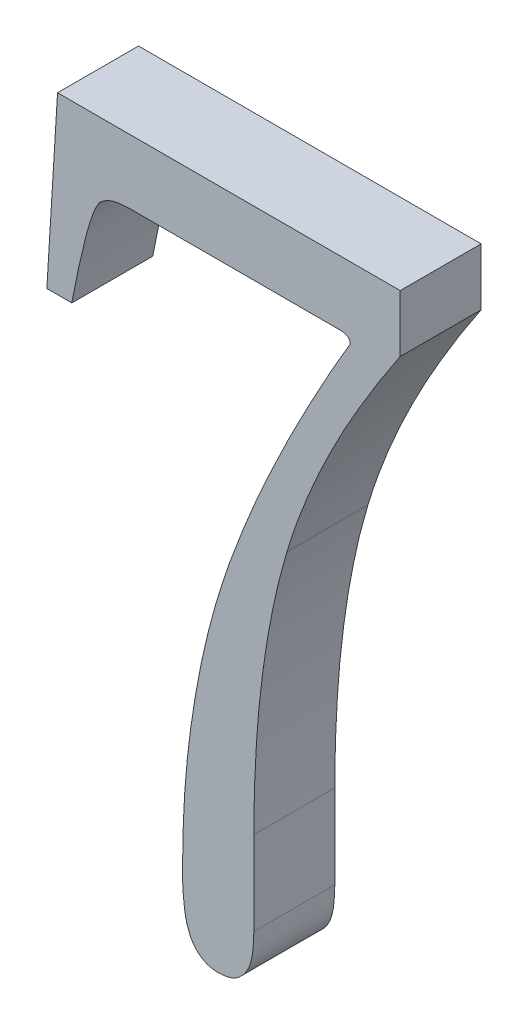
ISO-10303-21;
HEADER;
FILE_DESCRIPTION(('STEP AP214'),'2;1');
FILE_NAME('part.step','',(''),(''),'','','');
FILE_SCHEMA(('AUTOMOTIVE_DESIGN { 1 0 10303 214 1 1 1 1 }'));
ENDSEC;
DATA;
#1=APPLICATION_CONTEXT('core data for automotive mechanical design processes');
#2=APPLICATION_PROTOCOL_DEFINITION('international standard','automotive_design',2000,#1);
#3=PRODUCT_CONTEXT('',#1,'mechanical');
#4=PRODUCT('Part','Part','',(#3));
#5=PRODUCT_RELATED_PRODUCT_CATEGORY('part','',(#4));
#6=PRODUCT_DEFINITION_FORMATION('','',#4);
#7=PRODUCT_DEFINITION_CONTEXT('part definition',#1,'design');
#8=PRODUCT_DEFINITION('design','',#6,#7);
#9=PRODUCT_DEFINITION_SHAPE('','',#8);
#10=(LENGTH_UNIT() NAMED_UNIT(*) SI_UNIT(.MILLI.,.METRE.));
#11=(NAMED_UNIT(*) PLANE_ANGLE_UNIT() SI_UNIT($,.RADIAN.));
#12=(NAMED_UNIT(*) SI_UNIT($,.STERADIAN.) SOLID_ANGLE_UNIT());
#13=UNCERTAINTY_MEASURE_WITH_UNIT(LENGTH_MEASURE(1.E-05),#10,'distance_accuracy_value','');
#14=(GEOMETRIC_REPRESENTATION_CONTEXT(3) GLOBAL_UNCERTAINTY_ASSIGNED_CONTEXT((#13)) GLOBAL_UNIT_ASSIGNED_CONTEXT((#10,
#11,#12)) REPRESENTATION_CONTEXT('',''));
#15=CARTESIAN_POINT('',(0.,0.,0.));
#16=DIRECTION('',(0.,0.,1.));
#17=DIRECTION('',(1.,0.,0.));
#18=AXIS2_PLACEMENT_3D('',#15,#16,#17);
#19=CARTESIAN_POINT('',(2.24867724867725,17.1957671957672,3.));
#20=DIRECTION('',(-0.99813103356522,0.0611100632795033,0.));
#21=DIRECTION('',(-0.0611100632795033,-0.99813103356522,0.));
#22=AXIS2_PLACEMENT_3D('',#19,#20,#21);
#23=PLANE('',#22);
#24=DIRECTION('',(0.0611100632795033,0.99813103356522,0.));
#25=VECTOR('',#24,1.);
#26=CARTESIAN_POINT('',(2.24867724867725,17.1957671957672,0.));
#27=LINE('',#26,#25);
#28=CARTESIAN_POINT('',(2.24867724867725,17.1957671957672,0.));
#29=VERTEX_POINT('',#28);
#30=CARTESIAN_POINT('',(2.64550264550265,23.6772486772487,0.));
#31=VERTEX_POINT('',#30);
#32=EDGE_CURVE('E396',#29,#31,#27,.T.);
#33=ORIENTED_EDGE('',*,*,#32,.F.);
#34=DIRECTION('',(0.,0.,-1.));
#35=VECTOR('',#34,1.);
#36=CARTESIAN_POINT('',(2.24867724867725,17.1957671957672,3.));
#37=LINE('',#36,#35);
#38=CARTESIAN_POINT('',(2.24867724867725,17.1957671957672,3.));
#39=VERTEX_POINT('',#38);
#40=EDGE_CURVE('E11',#39,#29,#37,.T.);
#41=ORIENTED_EDGE('',*,*,#40,.F.);
#42=DIRECTION('',(0.0611100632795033,0.99813103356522,0.));
#43=VECTOR('',#42,1.);
#44=CARTESIAN_POINT('',(2.24867724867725,17.1957671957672,3.));
#45=LINE('',#44,#43);
#46=CARTESIAN_POINT('',(2.64550264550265,23.6772486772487,3.));
#47=VERTEX_POINT('',#46);
#48=EDGE_CURVE('E339',#39,#47,#45,.T.);
#49=ORIENTED_EDGE('',*,*,#48,.T.);
#50=DIRECTION('',(0.,0.,-1.));
#51=VECTOR('',#50,1.);
#52=CARTESIAN_POINT('',(2.64550264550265,23.6772486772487,3.));
#53=LINE('',#52,#51);
#54=EDGE_CURVE('E42',#47,#31,#53,.T.);
#55=ORIENTED_EDGE('',*,*,#54,.T.);
#56=EDGE_LOOP('',(#33,#41,#49,#55));
#57=FACE_BOUND('',#56,.T.);
#58=ADVANCED_FACE('F39',(#57),#23,.T.);
#59=CARTESIAN_POINT('',(3.17460317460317,17.1957671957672,3.));
#60=DIRECTION('',(0.,-1.,0.));
#61=DIRECTION('',(0.,0.,-1.));
#62=AXIS2_PLACEMENT_3D('',#59,#60,#61);
#63=PLANE('',#62);
#64=DIRECTION('',(-1.,0.,0.));
#65=VECTOR('',#64,1.);
#66=CARTESIAN_POINT('',(3.17460317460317,17.1957671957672,0.));
#67=LINE('',#66,#65);
#68=CARTESIAN_POINT('',(3.17460317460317,17.1957671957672,0.));
#69=VERTEX_POINT('',#68);
#70=EDGE_CURVE('E341',#69,#29,#67,.T.);
#71=ORIENTED_EDGE('',*,*,#70,.F.);
#72=DIRECTION('',(0.,0.,-1.));
#73=VECTOR('',#72,1.);
#74=CARTESIAN_POINT('',(3.17460317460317,17.1957671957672,3.));
#75=LINE('',#74,#73);
#76=CARTESIAN_POINT('',(3.17460317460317,17.1957671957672,3.));
#77=VERTEX_POINT('',#76);
#78=EDGE_CURVE('E49',#77,#69,#75,.T.);
#79=ORIENTED_EDGE('',*,*,#78,.F.);
#80=DIRECTION('',(-1.,0.,0.));
#81=VECTOR('',#80,1.);
#82=CARTESIAN_POINT('',(3.17460317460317,17.1957671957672,3.));
#83=LINE('',#82,#81);
#84=EDGE_CURVE('E182',#77,#39,#83,.T.);
#85=ORIENTED_EDGE('',*,*,#84,.T.);
#86=ORIENTED_EDGE('',*,*,#40,.T.);
#87=EDGE_LOOP('',(#71,#79,#85,#86));
#88=FACE_BOUND('',#87,.T.);
#89=ADVANCED_FACE('F538',(#88),#63,.T.);
#90=CARTESIAN_POINT('',(4.19851067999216,20.933764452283,3.));
#91=CARTESIAN_POINT('',(4.16119899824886,20.8740928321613,3.));
#92=CARTESIAN_POINT('',(4.0726667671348,20.7325054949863,3.));
#93=CARTESIAN_POINT('',(3.9603370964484,20.4664827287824,3.));
#94=CARTESIAN_POINT('',(3.84579289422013,20.1193902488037,3.));
#95=CARTESIAN_POINT('',(3.71634887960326,19.6942424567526,3.));
#96=CARTESIAN_POINT('',(3.59469285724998,19.1838157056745,3.));
#97=CARTESIAN_POINT('',(3.45485163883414,18.5952538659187,3.));
#98=CARTESIAN_POINT('',(3.31410550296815,17.9236254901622,3.));
#99=CARTESIAN_POINT('',(3.22283140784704,17.4473996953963,3.));
#100=CARTESIAN_POINT('',(3.17460317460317,17.1957671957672,3.));
#101=B_SPLINE_CURVE_WITH_KNOTS('',3,(#90,#91,#92,#93,#94,#95,#96,#97,#98,#99,#100),
.UNSPECIFIED.,.F.,.F.,(4,1,1,1,1,1,1,1,4),(0.,0.0541944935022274,0.128591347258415,
0.221755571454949,0.336073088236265,0.471036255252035,0.626171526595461,0.802473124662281,1.),.UNSPECIFIED.);
#102=DIRECTION('',(0.,0.,-1.));
#103=VECTOR('',#102,1.);
#104=SURFACE_OF_LINEAR_EXTRUSION('',#101,#103);
#105=CARTESIAN_POINT('',(4.19851067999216,20.933764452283,0.));
#106=CARTESIAN_POINT('',(4.16119899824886,20.8740928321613,0.));
#107=CARTESIAN_POINT('',(4.0726667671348,20.7325054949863,0.));
#108=CARTESIAN_POINT('',(3.9603370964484,20.4664827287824,0.));
#109=CARTESIAN_POINT('',(3.84579289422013,20.1193902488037,0.));
#110=CARTESIAN_POINT('',(3.71634887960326,19.6942424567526,0.));
#111=CARTESIAN_POINT('',(3.59469285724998,19.1838157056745,0.));
#112=CARTESIAN_POINT('',(3.45485163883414,18.5952538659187,0.));
#113=CARTESIAN_POINT('',(3.31410550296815,17.9236254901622,0.));
#114=CARTESIAN_POINT('',(3.22283140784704,17.4473996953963,0.));
#115=CARTESIAN_POINT('',(3.17460317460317,17.1957671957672,0.));
#116=B_SPLINE_CURVE_WITH_KNOTS('',3,(#105,#106,#107,#108,#109,#110,#111,#112,#113,#114,#115),
.UNSPECIFIED.,.F.,.F.,(4,1,1,1,1,1,1,1,4),(0.,0.0541944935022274,0.128591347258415,
0.221755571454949,0.336073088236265,0.471036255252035,0.626171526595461,0.802473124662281,1.),.UNSPECIFIED.);
#117=CARTESIAN_POINT('',(4.19851067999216,20.933764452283,0.));
#118=VERTEX_POINT('',#117);
#119=EDGE_CURVE('E168',#118,#69,#116,.T.);
#120=ORIENTED_EDGE('',*,*,#119,.F.);
#121=DIRECTION('',(0.,0.,-1.));
#122=VECTOR('',#121,1.);
#123=CARTESIAN_POINT('',(4.19851067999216,20.933764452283,3.));
#124=LINE('',#123,#122);
#125=CARTESIAN_POINT('',(4.19851067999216,20.933764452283,3.));
#126=VERTEX_POINT('',#125);
#127=EDGE_CURVE('E163',#126,#118,#124,.T.);
#128=ORIENTED_EDGE('',*,*,#127,.F.);
#129=EDGE_CURVE('E166',#126,#77,#101,.T.);
#130=ORIENTED_EDGE('',*,*,#129,.T.);
#131=ORIENTED_EDGE('',*,*,#78,.T.);
#132=EDGE_LOOP('',(#120,#128,#130,#131));
#133=FACE_BOUND('',#132,.T.);
#134=ADVANCED_FACE('F165',(#133),#104,.T.);
#135=CARTESIAN_POINT('',(5.29100529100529,21.2962962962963,3.));
#136=CARTESIAN_POINT('',(5.17811127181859,21.2909425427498,3.));
#137=CARTESIAN_POINT('',(4.96343796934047,21.2807621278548,3.));
#138=CARTESIAN_POINT('',(4.66011938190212,21.2226561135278,3.));
#139=CARTESIAN_POINT('',(4.40260331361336,21.1031911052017,3.));
#140=CARTESIAN_POINT('',(4.26504484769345,20.9889975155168,3.));
#141=CARTESIAN_POINT('',(4.19851067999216,20.933764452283,3.));
#142=B_SPLINE_CURVE_WITH_KNOTS('',3,(#135,#136,#137,#138,#139,#140,#141),.UNSPECIFIED.,.F.,.F.,
(4,1,1,1,4),(0.,0.287395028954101,0.546495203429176,0.780649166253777,1.),.UNSPECIFIED.);
#143=DIRECTION('',(0.,0.,-1.));
#144=VECTOR('',#143,1.);
#145=SURFACE_OF_LINEAR_EXTRUSION('',#142,#144);
#146=CARTESIAN_POINT('',(5.29100529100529,21.2962962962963,0.));
#147=CARTESIAN_POINT('',(5.17811127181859,21.2909425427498,0.));
#148=CARTESIAN_POINT('',(4.96343796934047,21.2807621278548,0.));
#149=CARTESIAN_POINT('',(4.66011938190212,21.2226561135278,0.));
#150=CARTESIAN_POINT('',(4.40260331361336,21.1031911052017,0.));
#151=CARTESIAN_POINT('',(4.26504484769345,20.9889975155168,0.));
#152=CARTESIAN_POINT('',(4.19851067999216,20.933764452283,0.));
#153=B_SPLINE_CURVE_WITH_KNOTS('',3,(#146,#147,#148,#149,#150,#151,#152),.UNSPECIFIED.,.F.,.F.,
(4,1,1,1,4),(0.,0.287395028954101,0.546495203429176,0.780649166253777,1.),.UNSPECIFIED.);
#154=CARTESIAN_POINT('',(5.29100529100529,21.2962962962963,0.));
#155=VERTEX_POINT('',#154);
#156=EDGE_CURVE('E348',#155,#118,#153,.T.);
#157=ORIENTED_EDGE('',*,*,#156,.F.);
#158=DIRECTION('',(0.,0.,-1.));
#159=VECTOR('',#158,1.);
#160=CARTESIAN_POINT('',(5.29100529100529,21.2962962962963,3.));
#161=LINE('',#160,#159);
#162=CARTESIAN_POINT('',(5.29100529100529,21.2962962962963,3.));
#163=VERTEX_POINT('',#162);
#164=EDGE_CURVE('E174',#163,#155,#161,.T.);
#165=ORIENTED_EDGE('',*,*,#164,.F.);
#166=EDGE_CURVE('E180',#163,#126,#142,.T.);
#167=ORIENTED_EDGE('',*,*,#166,.T.);
#168=ORIENTED_EDGE('',*,*,#127,.T.);
#169=EDGE_LOOP('',(#157,#165,#167,#168));
#170=FACE_BOUND('',#169,.T.);
#171=ADVANCED_FACE('F185',(#170),#145,.T.);
#172=CARTESIAN_POINT('',(13.0952380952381,21.2962962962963,3.));
#173=DIRECTION('',(0.,-1.,0.));
#174=DIRECTION('',(0.,0.,-1.));
#175=AXIS2_PLACEMENT_3D('',#172,#173,#174);
#176=PLANE('',#175);
#177=DIRECTION('',(-1.,0.,0.));
#178=VECTOR('',#177,1.);
#179=CARTESIAN_POINT('',(13.0952380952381,21.2962962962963,0.));
#180=LINE('',#179,#178);
#181=CARTESIAN_POINT('',(13.0952380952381,21.2962962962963,0.));
#182=VERTEX_POINT('',#181);
#183=EDGE_CURVE('E489',#182,#155,#180,.T.);
#184=ORIENTED_EDGE('',*,*,#183,.F.);
#185=DIRECTION('',(0.,0.,-1.));
#186=VECTOR('',#185,1.);
#187=CARTESIAN_POINT('',(13.0952380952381,21.2962962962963,3.));
#188=LINE('',#187,#186);
#189=CARTESIAN_POINT('',(13.0952380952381,21.2962962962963,3.));
#190=VERTEX_POINT('',#189);
#191=EDGE_CURVE('E358',#190,#182,#188,.T.);
#192=ORIENTED_EDGE('',*,*,#191,.F.);
#193=DIRECTION('',(-1.,0.,0.));
#194=VECTOR('',#193,1.);
#195=CARTESIAN_POINT('',(13.0952380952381,21.2962962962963,3.));
#196=LINE('',#195,#194);
#197=EDGE_CURVE('E187',#190,#163,#196,.T.);
#198=ORIENTED_EDGE('',*,*,#197,.T.);
#199=ORIENTED_EDGE('',*,*,#164,.T.);
#200=EDGE_LOOP('',(#184,#192,#198,#199));
#201=FACE_BOUND('',#200,.T.);
#202=ADVANCED_FACE('F207',(#201),#176,.T.);
#203=CARTESIAN_POINT('',(13.4920634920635,21.031746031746,3.));
#204=CARTESIAN_POINT('',(13.4882682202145,21.0725959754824,3.));
#205=CARTESIAN_POINT('',(13.4809631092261,21.1512236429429,3.));
#206=CARTESIAN_POINT('',(13.3921041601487,21.2469746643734,3.));
#207=CARTESIAN_POINT('',(13.2556322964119,21.2910057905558,3.));
#208=CARTESIAN_POINT('',(13.1526653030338,21.2944020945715,3.));
#209=CARTESIAN_POINT('',(13.0952380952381,21.2962962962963,3.));
#210=B_SPLINE_CURVE_WITH_KNOTS('',3,(#203,#204,#205,#206,#207,#208,#209),.UNSPECIFIED.,.F.,.F.,
(4,1,1,1,4),(0.,0.22251847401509,0.428301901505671,0.681150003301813,1.),.UNSPECIFIED.);
#211=DIRECTION('',(0.,0.,-1.));
#212=VECTOR('',#211,1.);
#213=SURFACE_OF_LINEAR_EXTRUSION('',#210,#212);
#214=CARTESIAN_POINT('',(13.4920634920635,21.031746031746,0.));
#215=CARTESIAN_POINT('',(13.4882682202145,21.0725959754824,0.));
#216=CARTESIAN_POINT('',(13.4809631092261,21.1512236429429,0.));
#217=CARTESIAN_POINT('',(13.3921041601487,21.2469746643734,0.));
#218=CARTESIAN_POINT('',(13.2556322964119,21.2910057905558,0.));
#219=CARTESIAN_POINT('',(13.1526653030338,21.2944020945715,0.));
#220=CARTESIAN_POINT('',(13.0952380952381,21.2962962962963,0.));
#221=B_SPLINE_CURVE_WITH_KNOTS('',3,(#214,#215,#216,#217,#218,#219,#220),.UNSPECIFIED.,.F.,.F.,
(4,1,1,1,4),(0.,0.22251847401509,0.428301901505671,0.681150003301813,1.),.UNSPECIFIED.);
#222=CARTESIAN_POINT('',(13.4920634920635,21.031746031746,0.));
#223=VERTEX_POINT('',#222);
#224=EDGE_CURVE('E480',#223,#182,#221,.T.);
#225=ORIENTED_EDGE('',*,*,#224,.F.);
#226=DIRECTION('',(0.,0.,-1.));
#227=VECTOR('',#226,1.);
#228=CARTESIAN_POINT('',(13.4920634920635,21.031746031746,3.));
#229=LINE('',#228,#227);
#230=CARTESIAN_POINT('',(13.4920634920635,21.031746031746,3.));
#231=VERTEX_POINT('',#230);
#232=EDGE_CURVE('E361',#231,#223,#229,.T.);
#233=ORIENTED_EDGE('',*,*,#232,.F.);
#234=EDGE_CURVE('E190',#231,#190,#210,.T.);
#235=ORIENTED_EDGE('',*,*,#234,.T.);
#236=ORIENTED_EDGE('',*,*,#191,.T.);
#237=EDGE_LOOP('',(#225,#233,#235,#236));
#238=FACE_BOUND('',#237,.T.);
#239=ADVANCED_FACE('F211',(#238),#213,.T.);
#240=CARTESIAN_POINT('',(9.02900254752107,11.8067803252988,3.));
#241=CARTESIAN_POINT('',(9.16608637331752,12.1732388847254,3.));
#242=CARTESIAN_POINT('',(9.44406047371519,12.9163315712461,3.));
#243=CARTESIAN_POINT('',(9.89826375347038,14.031894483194,3.));
#244=CARTESIAN_POINT('',(10.4019146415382,15.1599348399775,3.));
#245=CARTESIAN_POINT('',(10.9395374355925,16.3055951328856,3.));
#246=CARTESIAN_POINT('',(11.5180050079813,17.4668857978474,3.));
#247=CARTESIAN_POINT('',(12.137830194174,18.6432083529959,3.));
#248=CARTESIAN_POINT('',(12.7898906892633,19.8390796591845,3.));
#249=CARTESIAN_POINT('',(13.2563019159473,20.6312963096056,3.));
#250=CARTESIAN_POINT('',(13.4920634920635,21.031746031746,3.));
#251=B_SPLINE_CURVE_WITH_KNOTS('',3,(#240,#241,#242,#243,#244,#245,#246,#247,#248,#249,#250),
.UNSPECIFIED.,.F.,.F.,(4,1,1,1,1,1,1,1,4),(0.,0.114375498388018,0.231926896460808,
0.352039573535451,0.475476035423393,0.601865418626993,0.731268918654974,0.864161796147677,1.),.UNSPECIFIED.);
#252=DIRECTION('',(0.,0.,-1.));
#253=VECTOR('',#252,1.);
#254=SURFACE_OF_LINEAR_EXTRUSION('',#251,#253);
#255=CARTESIAN_POINT('',(9.02900254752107,11.8067803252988,0.));
#256=CARTESIAN_POINT('',(9.16608637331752,12.1732388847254,0.));
#257=CARTESIAN_POINT('',(9.44406047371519,12.9163315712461,0.));
#258=CARTESIAN_POINT('',(9.89826375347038,14.031894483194,0.));
#259=CARTESIAN_POINT('',(10.4019146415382,15.1599348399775,0.));
#260=CARTESIAN_POINT('',(10.9395374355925,16.3055951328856,0.));
#261=CARTESIAN_POINT('',(11.5180050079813,17.4668857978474,0.));
#262=CARTESIAN_POINT('',(12.137830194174,18.6432083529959,0.));
#263=CARTESIAN_POINT('',(12.7898906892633,19.8390796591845,0.));
#264=CARTESIAN_POINT('',(13.2563019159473,20.6312963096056,0.));
#265=CARTESIAN_POINT('',(13.4920634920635,21.031746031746,0.));
#266=B_SPLINE_CURVE_WITH_KNOTS('',3,(#255,#256,#257,#258,#259,#260,#261,#262,#263,#264,#265),
.UNSPECIFIED.,.F.,.F.,(4,1,1,1,1,1,1,1,4),(0.,0.114375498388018,0.231926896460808,
0.352039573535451,0.475476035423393,0.601865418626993,0.731268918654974,0.864161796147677,1.),.UNSPECIFIED.);
#267=CARTESIAN_POINT('',(9.02900254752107,11.8067803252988,0.));
#268=VERTEX_POINT('',#267);
#269=EDGE_CURVE('E471',#268,#223,#266,.T.);
#270=ORIENTED_EDGE('',*,*,#269,.F.);
#271=DIRECTION('',(0.,0.,-1.));
#272=VECTOR('',#271,1.);
#273=CARTESIAN_POINT('',(9.02900254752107,11.8067803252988,3.));
#274=LINE('',#273,#272);
#275=CARTESIAN_POINT('',(9.02900254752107,11.8067803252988,3.));
#276=VERTEX_POINT('',#275);
#277=EDGE_CURVE('E364',#276,#268,#274,.T.);
#278=ORIENTED_EDGE('',*,*,#277,.F.);
#279=EDGE_CURVE('E224',#276,#231,#251,.T.);
#280=ORIENTED_EDGE('',*,*,#279,.T.);
#281=ORIENTED_EDGE('',*,*,#232,.T.);
#282=EDGE_LOOP('',(#270,#278,#280,#281));
#283=FACE_BOUND('',#282,.T.);
#284=ADVANCED_FACE('F215',(#283),#254,.T.);
#285=CARTESIAN_POINT('',(7.27513227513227,1.05820105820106,3.));
#286=CARTESIAN_POINT('',(7.28160009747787,1.53840215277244,3.));
#287=CARTESIAN_POINT('',(7.29443415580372,2.49126209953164,3.));
#288=CARTESIAN_POINT('',(7.37194548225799,3.90528842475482,3.));
#289=CARTESIAN_POINT('',(7.50912942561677,5.29310268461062,3.));
#290=CARTESIAN_POINT('',(7.70634409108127,6.6506944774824,3.));
#291=CARTESIAN_POINT('',(7.95060801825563,7.98317568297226,3.));
#292=CARTESIAN_POINT('',(8.24849569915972,9.28667035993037,3.));
#293=CARTESIAN_POINT('',(8.60439717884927,10.5622466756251,3.));
#294=CARTESIAN_POINT('',(8.88791117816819,11.3932364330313,3.));
#295=CARTESIAN_POINT('',(9.02900254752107,11.8067803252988,3.));
#296=B_SPLINE_CURVE_WITH_KNOTS('',3,(#285,#286,#287,#288,#289,#290,#291,#292,#293,#294,#295),
.UNSPECIFIED.,.F.,.F.,(4,1,1,1,1,1,1,1,4),(0.,0.131640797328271,0.261213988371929,
0.388076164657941,0.513808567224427,0.637173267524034,0.759343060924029,0.880236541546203,1.),.UNSPECIFIED.);
#297=DIRECTION('',(0.,0.,-1.));
#298=VECTOR('',#297,1.);
#299=SURFACE_OF_LINEAR_EXTRUSION('',#296,#298);
#300=CARTESIAN_POINT('',(7.27513227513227,1.05820105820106,0.));
#301=CARTESIAN_POINT('',(7.28160009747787,1.53840215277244,0.));
#302=CARTESIAN_POINT('',(7.29443415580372,2.49126209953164,0.));
#303=CARTESIAN_POINT('',(7.37194548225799,3.90528842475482,0.));
#304=CARTESIAN_POINT('',(7.50912942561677,5.29310268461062,0.));
#305=CARTESIAN_POINT('',(7.70634409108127,6.6506944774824,0.));
#306=CARTESIAN_POINT('',(7.95060801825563,7.98317568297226,0.));
#307=CARTESIAN_POINT('',(8.24849569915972,9.28667035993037,0.));
#308=CARTESIAN_POINT('',(8.60439717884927,10.5622466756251,0.));
#309=CARTESIAN_POINT('',(8.88791117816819,11.3932364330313,0.));
#310=CARTESIAN_POINT('',(9.02900254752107,11.8067803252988,0.));
#311=B_SPLINE_CURVE_WITH_KNOTS('',3,(#300,#301,#302,#303,#304,#305,#306,#307,#308,#309,#310),
.UNSPECIFIED.,.F.,.F.,(4,1,1,1,1,1,1,1,4),(0.,0.131640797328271,0.261213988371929,
0.388076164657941,0.513808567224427,0.637173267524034,0.759343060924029,0.880236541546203,1.),.UNSPECIFIED.);
#312=CARTESIAN_POINT('',(7.27513227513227,1.05820105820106,0.));
#313=VERTEX_POINT('',#312);
#314=EDGE_CURVE('E462',#313,#268,#311,.T.);
#315=ORIENTED_EDGE('',*,*,#314,.F.);
#316=DIRECTION('',(0.,0.,-1.));
#317=VECTOR('',#316,1.);
#318=CARTESIAN_POINT('',(7.27513227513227,1.05820105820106,3.));
#319=LINE('',#318,#317);
#320=CARTESIAN_POINT('',(7.27513227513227,1.05820105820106,3.));
#321=VERTEX_POINT('',#320);
#322=EDGE_CURVE('E367',#321,#313,#319,.T.);
#323=ORIENTED_EDGE('',*,*,#322,.F.);
#324=EDGE_CURVE('E234',#321,#276,#296,.T.);
#325=ORIENTED_EDGE('',*,*,#324,.T.);
#326=ORIENTED_EDGE('',*,*,#277,.T.);
#327=EDGE_LOOP('',(#315,#323,#325,#326));
#328=FACE_BOUND('',#327,.T.);
#329=ADVANCED_FACE('F252',(#328),#299,.T.);
#330=CARTESIAN_POINT('',(7.57397609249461,-0.960219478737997,3.));
#331=CARTESIAN_POINT('',(7.52603342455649,-0.840535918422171,3.));
#332=CARTESIAN_POINT('',(7.41972281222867,-0.575143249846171,3.));
#333=CARTESIAN_POINT('',(7.33832415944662,-0.110616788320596,3.));
#334=CARTESIAN_POINT('',(7.28487612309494,0.442814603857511,3.));
#335=CARTESIAN_POINT('',(7.27854856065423,0.842440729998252,3.));
#336=CARTESIAN_POINT('',(7.27513227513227,1.05820105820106,3.));
#337=B_SPLINE_CURVE_WITH_KNOTS('',3,(#330,#331,#332,#333,#334,#335,#336),.UNSPECIFIED.,.F.,.F.,
(4,1,1,1,4),(0.,0.187877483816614,0.416609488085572,0.685024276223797,1.),.UNSPECIFIED.);
#338=DIRECTION('',(0.,0.,-1.));
#339=VECTOR('',#338,1.);
#340=SURFACE_OF_LINEAR_EXTRUSION('',#337,#339);
#341=CARTESIAN_POINT('',(7.57397609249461,-0.960219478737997,0.));
#342=CARTESIAN_POINT('',(7.52603342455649,-0.840535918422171,0.));
#343=CARTESIAN_POINT('',(7.41972281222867,-0.575143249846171,0.));
#344=CARTESIAN_POINT('',(7.33832415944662,-0.110616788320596,0.));
#345=CARTESIAN_POINT('',(7.28487612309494,0.442814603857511,0.));
#346=CARTESIAN_POINT('',(7.27854856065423,0.842440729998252,0.));
#347=CARTESIAN_POINT('',(7.27513227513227,1.05820105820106,0.));
#348=B_SPLINE_CURVE_WITH_KNOTS('',3,(#341,#342,#343,#344,#345,#346,#347),.UNSPECIFIED.,.F.,.F.,
(4,1,1,1,4),(0.,0.187877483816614,0.416609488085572,0.685024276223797,1.),.UNSPECIFIED.);
#349=CARTESIAN_POINT('',(7.57397609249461,-0.960219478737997,0.));
#350=VERTEX_POINT('',#349);
#351=EDGE_CURVE('E453',#350,#313,#348,.T.);
#352=ORIENTED_EDGE('',*,*,#351,.F.);
#353=DIRECTION('',(0.,0.,-1.));
#354=VECTOR('',#353,1.);
#355=CARTESIAN_POINT('',(7.57397609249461,-0.960219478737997,3.));
#356=LINE('',#355,#354);
#357=CARTESIAN_POINT('',(7.57397609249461,-0.960219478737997,3.));
#358=VERTEX_POINT('',#357);
#359=EDGE_CURVE('E370',#358,#350,#356,.T.);
#360=ORIENTED_EDGE('',*,*,#359,.F.);
#361=EDGE_CURVE('E244',#358,#321,#337,.T.);
#362=ORIENTED_EDGE('',*,*,#361,.T.);
#363=ORIENTED_EDGE('',*,*,#322,.T.);
#364=EDGE_LOOP('',(#352,#360,#362,#363));
#365=FACE_BOUND('',#364,.T.);
#366=ADVANCED_FACE('F255',(#365),#340,.T.);
#367=CARTESIAN_POINT('',(8.5978835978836,-1.58730158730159,3.));
#368=CARTESIAN_POINT('',(8.49208149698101,-1.58047349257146,3.));
#369=CARTESIAN_POINT('',(8.28633657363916,-1.56719544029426,3.));
#370=CARTESIAN_POINT('',(7.99999480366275,-1.44131274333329,3.));
#371=CARTESIAN_POINT('',(7.75507631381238,-1.23634905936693,3.));
#372=CARTESIAN_POINT('',(7.63641890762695,-1.05542813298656,3.));
#373=CARTESIAN_POINT('',(7.57397609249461,-0.960219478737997,3.));
#374=B_SPLINE_CURVE_WITH_KNOTS('',3,(#367,#368,#369,#370,#371,#372,#373),.UNSPECIFIED.,.F.,.F.,
(4,1,1,1,4),(0.,0.250662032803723,0.487442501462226,0.730269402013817,1.),.UNSPECIFIED.);
#375=DIRECTION('',(0.,0.,-1.));
#376=VECTOR('',#375,1.);
#377=SURFACE_OF_LINEAR_EXTRUSION('',#374,#376);
#378=CARTESIAN_POINT('',(8.5978835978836,-1.58730158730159,0.));
#379=CARTESIAN_POINT('',(8.49208149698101,-1.58047349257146,0.));
#380=CARTESIAN_POINT('',(8.28633657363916,-1.56719544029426,0.));
#381=CARTESIAN_POINT('',(7.99999480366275,-1.44131274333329,0.));
#382=CARTESIAN_POINT('',(7.75507631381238,-1.23634905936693,0.));
#383=CARTESIAN_POINT('',(7.63641890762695,-1.05542813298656,0.));
#384=CARTESIAN_POINT('',(7.57397609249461,-0.960219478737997,0.));
#385=B_SPLINE_CURVE_WITH_KNOTS('',3,(#378,#379,#380,#381,#382,#383,#384),.UNSPECIFIED.,.F.,.F.,
(4,1,1,1,4),(0.,0.250662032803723,0.487442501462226,0.730269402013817,1.),.UNSPECIFIED.);
#386=CARTESIAN_POINT('',(8.5978835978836,-1.58730158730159,0.));
#387=VERTEX_POINT('',#386);
#388=EDGE_CURVE('E444',#387,#350,#385,.T.);
#389=ORIENTED_EDGE('',*,*,#388,.F.);
#390=DIRECTION('',(0.,0.,-1.));
#391=VECTOR('',#390,1.);
#392=CARTESIAN_POINT('',(8.5978835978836,-1.58730158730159,3.));
#393=LINE('',#392,#391);
#394=CARTESIAN_POINT('',(8.5978835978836,-1.58730158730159,3.));
#395=VERTEX_POINT('',#394);
#396=EDGE_CURVE('E373',#395,#387,#393,.T.);
#397=ORIENTED_EDGE('',*,*,#396,.F.);
#398=EDGE_CURVE('E267',#395,#358,#374,.T.);
#399=ORIENTED_EDGE('',*,*,#398,.T.);
#400=ORIENTED_EDGE('',*,*,#359,.T.);
#401=EDGE_LOOP('',(#389,#397,#399,#400));
#402=FACE_BOUND('',#401,.T.);
#403=ADVANCED_FACE('F259',(#402),#377,.T.);
#404=CARTESIAN_POINT('',(9.5581030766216,-1.15618263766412,3.));
#405=CARTESIAN_POINT('',(9.49879024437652,-1.22126769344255,3.));
#406=CARTESIAN_POINT('',(9.3809814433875,-1.35054144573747,3.));
#407=CARTESIAN_POINT('',(9.15278187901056,-1.49240324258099,3.));
#408=CARTESIAN_POINT('',(8.88523636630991,-1.56964495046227,3.));
#409=CARTESIAN_POINT('',(8.69635520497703,-1.58125091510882,3.));
#410=CARTESIAN_POINT('',(8.5978835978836,-1.58730158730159,3.));
#411=B_SPLINE_CURVE_WITH_KNOTS('',3,(#404,#405,#406,#407,#408,#409,#410),.UNSPECIFIED.,.F.,.F.,
(4,1,1,1,4),(0.,0.241635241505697,0.479942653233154,0.728872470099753,1.),.UNSPECIFIED.);
#412=DIRECTION('',(0.,0.,-1.));
#413=VECTOR('',#412,1.);
#414=SURFACE_OF_LINEAR_EXTRUSION('',#411,#413);
#415=CARTESIAN_POINT('',(9.5581030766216,-1.15618263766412,0.));
#416=CARTESIAN_POINT('',(9.49879024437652,-1.22126769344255,0.));
#417=CARTESIAN_POINT('',(9.3809814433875,-1.35054144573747,0.));
#418=CARTESIAN_POINT('',(9.15278187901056,-1.49240324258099,0.));
#419=CARTESIAN_POINT('',(8.88523636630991,-1.56964495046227,0.));
#420=CARTESIAN_POINT('',(8.69635520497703,-1.58125091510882,0.));
#421=CARTESIAN_POINT('',(8.5978835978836,-1.58730158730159,0.));
#422=B_SPLINE_CURVE_WITH_KNOTS('',3,(#415,#416,#417,#418,#419,#420,#421),.UNSPECIFIED.,.F.,.F.,
(4,1,1,1,4),(0.,0.241635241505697,0.479942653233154,0.728872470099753,1.),.UNSPECIFIED.);
#423=CARTESIAN_POINT('',(9.5581030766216,-1.15618263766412,0.));
#424=VERTEX_POINT('',#423);
#425=EDGE_CURVE('E435',#424,#387,#422,.T.);
#426=ORIENTED_EDGE('',*,*,#425,.F.);
#427=DIRECTION('',(0.,0.,-1.));
#428=VECTOR('',#427,1.);
#429=CARTESIAN_POINT('',(9.5581030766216,-1.15618263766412,3.));
#430=LINE('',#429,#428);
#431=CARTESIAN_POINT('',(9.5581030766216,-1.15618263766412,3.));
#432=VERTEX_POINT('',#431);
#433=EDGE_CURVE('E376',#432,#424,#430,.T.);
#434=ORIENTED_EDGE('',*,*,#433,.F.);
#435=EDGE_CURVE('E273',#432,#395,#411,.T.);
#436=ORIENTED_EDGE('',*,*,#435,.T.);
#437=ORIENTED_EDGE('',*,*,#396,.T.);
#438=EDGE_LOOP('',(#426,#434,#436,#437));
#439=FACE_BOUND('',#438,.T.);
#440=ADVANCED_FACE('F263',(#439),#414,.T.);
#441=CARTESIAN_POINT('',(9.92063492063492,0.396825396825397,3.));
#442=CARTESIAN_POINT('',(9.91562175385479,0.223515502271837,3.));
#443=CARTESIAN_POINT('',(9.90640621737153,-0.0950742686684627,3.));
#444=CARTESIAN_POINT('',(9.84961978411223,-0.531595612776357,3.));
#445=CARTESIAN_POINT('',(9.73727645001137,-0.885927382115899,3.));
#446=CARTESIAN_POINT('',(9.61417782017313,-1.07160258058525,3.));
#447=CARTESIAN_POINT('',(9.5581030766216,-1.15618263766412,3.));
#448=B_SPLINE_CURVE_WITH_KNOTS('',3,(#441,#442,#443,#444,#445,#446,#447),.UNSPECIFIED.,.F.,.F.,
(4,1,1,1,4),(0.,0.320613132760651,0.589372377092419,0.812948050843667,1.),.UNSPECIFIED.);
#449=DIRECTION('',(0.,0.,-1.));
#450=VECTOR('',#449,1.);
#451=SURFACE_OF_LINEAR_EXTRUSION('',#448,#450);
#452=CARTESIAN_POINT('',(9.92063492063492,0.396825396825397,0.));
#453=CARTESIAN_POINT('',(9.91562175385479,0.223515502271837,0.));
#454=CARTESIAN_POINT('',(9.90640621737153,-0.0950742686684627,0.));
#455=CARTESIAN_POINT('',(9.84961978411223,-0.531595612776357,0.));
#456=CARTESIAN_POINT('',(9.73727645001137,-0.885927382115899,0.));
#457=CARTESIAN_POINT('',(9.61417782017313,-1.07160258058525,0.));
#458=CARTESIAN_POINT('',(9.5581030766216,-1.15618263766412,0.));
#459=B_SPLINE_CURVE_WITH_KNOTS('',3,(#452,#453,#454,#455,#456,#457,#458),.UNSPECIFIED.,.F.,.F.,
(4,1,1,1,4),(0.,0.320613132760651,0.589372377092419,0.812948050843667,1.),.UNSPECIFIED.);
#460=CARTESIAN_POINT('',(9.92063492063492,0.396825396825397,0.));
#461=VERTEX_POINT('',#460);
#462=EDGE_CURVE('E429',#461,#424,#459,.T.);
#463=ORIENTED_EDGE('',*,*,#462,.F.);
#464=DIRECTION('',(0.,0.,-1.));
#465=VECTOR('',#464,1.);
#466=CARTESIAN_POINT('',(9.92063492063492,0.396825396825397,3.));
#467=LINE('',#466,#465);
#468=CARTESIAN_POINT('',(9.92063492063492,0.396825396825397,3.));
#469=VERTEX_POINT('',#468);
#470=EDGE_CURVE('E379',#469,#461,#467,.T.);
#471=ORIENTED_EDGE('',*,*,#470,.F.);
#472=EDGE_CURVE('E283',#469,#432,#448,.T.);
#473=ORIENTED_EDGE('',*,*,#472,.T.);
#474=ORIENTED_EDGE('',*,*,#433,.T.);
#475=EDGE_LOOP('',(#463,#471,#473,#474));
#476=FACE_BOUND('',#475,.T.);
#477=ADVANCED_FACE('F298',(#476),#451,.T.);
#478=CARTESIAN_POINT('',(9.92063492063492,3.50774054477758,3.));
#479=DIRECTION('',(1.,0.,0.));
#480=DIRECTION('',(0.,0.,-1.));
#481=AXIS2_PLACEMENT_3D('',#478,#479,#480);
#482=PLANE('',#481);
#483=DIRECTION('',(0.,-1.,0.));
#484=VECTOR('',#483,1.);
#485=CARTESIAN_POINT('',(9.92063492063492,3.50774054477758,0.));
#486=LINE('',#485,#484);
#487=CARTESIAN_POINT('',(9.92063492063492,3.50774054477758,0.));
#488=VERTEX_POINT('',#487);
#489=EDGE_CURVE('E422',#488,#461,#486,.T.);
#490=ORIENTED_EDGE('',*,*,#489,.F.);
#491=DIRECTION('',(0.,0.,-1.));
#492=VECTOR('',#491,1.);
#493=CARTESIAN_POINT('',(9.92063492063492,3.50774054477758,3.));
#494=LINE('',#493,#492);
#495=CARTESIAN_POINT('',(9.92063492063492,3.50774054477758,3.));
#496=VERTEX_POINT('',#495);
#497=EDGE_CURVE('E382',#496,#488,#494,.T.);
#498=ORIENTED_EDGE('',*,*,#497,.F.);
#499=DIRECTION('',(0.,-1.,0.));
#500=VECTOR('',#499,1.);
#501=CARTESIAN_POINT('',(9.92063492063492,3.50774054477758,3.));
#502=LINE('',#501,#500);
#503=EDGE_CURVE('E293',#496,#469,#502,.T.);
#504=ORIENTED_EDGE('',*,*,#503,.T.);
#505=ORIENTED_EDGE('',*,*,#470,.T.);
#506=EDGE_LOOP('',(#490,#498,#504,#505));
#507=FACE_BOUND('',#506,.T.);
#508=ADVANCED_FACE('F301',(#507),#482,.T.);
#509=CARTESIAN_POINT('',(11.1454046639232,13.1932196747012,3.));
#510=CARTESIAN_POINT('',(11.0452807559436,12.8447203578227,3.));
#511=CARTESIAN_POINT('',(10.8420775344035,12.1374349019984,3.));
#512=CARTESIAN_POINT('',(10.6031931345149,11.0399211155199,3.));
#513=CARTESIAN_POINT('',(10.3896772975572,9.89847717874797,3.));
#514=CARTESIAN_POINT('',(10.2223663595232,8.70799355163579,3.));
#515=CARTESIAN_POINT('',(10.0814392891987,7.47341673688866,3.));
#516=CARTESIAN_POINT('',(9.99345255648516,6.19178292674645,3.));
#517=CARTESIAN_POINT('',(9.93095296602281,4.86540586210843,3.));
#518=CARTESIAN_POINT('',(9.92411052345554,3.96506605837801,3.));
#519=CARTESIAN_POINT('',(9.92063492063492,3.50774054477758,3.));
#520=B_SPLINE_CURVE_WITH_KNOTS('',3,(#509,#510,#511,#512,#513,#514,#515,#516,#517,#518,#519),
.UNSPECIFIED.,.F.,.F.,(4,1,1,1,1,1,1,1,4),(0.,0.111019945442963,0.225316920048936,
0.343813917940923,0.466598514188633,0.593405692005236,0.724283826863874,0.859950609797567,1.),.UNSPECIFIED.);
#521=DIRECTION('',(0.,0.,-1.));
#522=VECTOR('',#521,1.);
#523=SURFACE_OF_LINEAR_EXTRUSION('',#520,#522);
#524=CARTESIAN_POINT('',(11.1454046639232,13.1932196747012,0.));
#525=CARTESIAN_POINT('',(11.0452807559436,12.8447203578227,0.));
#526=CARTESIAN_POINT('',(10.8420775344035,12.1374349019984,0.));
#527=CARTESIAN_POINT('',(10.6031931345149,11.0399211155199,0.));
#528=CARTESIAN_POINT('',(10.3896772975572,9.89847717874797,0.));
#529=CARTESIAN_POINT('',(10.2223663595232,8.70799355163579,0.));
#530=CARTESIAN_POINT('',(10.0814392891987,7.47341673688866,0.));
#531=CARTESIAN_POINT('',(9.99345255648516,6.19178292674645,0.));
#532=CARTESIAN_POINT('',(9.93095296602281,4.86540586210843,0.));
#533=CARTESIAN_POINT('',(9.92411052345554,3.96506605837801,0.));
#534=CARTESIAN_POINT('',(9.92063492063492,3.50774054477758,0.));
#535=B_SPLINE_CURVE_WITH_KNOTS('',3,(#524,#525,#526,#527,#528,#529,#530,#531,#532,#533,#534),
.UNSPECIFIED.,.F.,.F.,(4,1,1,1,1,1,1,1,4),(0.,0.111019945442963,0.225316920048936,
0.343813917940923,0.466598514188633,0.593405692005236,0.724283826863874,0.859950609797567,1.),.UNSPECIFIED.);
#536=CARTESIAN_POINT('',(11.1454046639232,13.1932196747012,0.));
#537=VERTEX_POINT('',#536);
#538=EDGE_CURVE('E413',#537,#488,#535,.T.);
#539=ORIENTED_EDGE('',*,*,#538,.F.);
#540=DIRECTION('',(0.,0.,-1.));
#541=VECTOR('',#540,1.);
#542=CARTESIAN_POINT('',(11.1454046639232,13.1932196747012,3.));
#543=LINE('',#542,#541);
#544=CARTESIAN_POINT('',(11.1454046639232,13.1932196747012,3.));
#545=VERTEX_POINT('',#544);
#546=EDGE_CURVE('E385',#545,#537,#543,.T.);
#547=ORIENTED_EDGE('',*,*,#546,.F.);
#548=EDGE_CURVE('E313',#545,#496,#520,.T.);
#549=ORIENTED_EDGE('',*,*,#548,.T.);
#550=ORIENTED_EDGE('',*,*,#497,.T.);
#551=EDGE_LOOP('',(#539,#547,#549,#550));
#552=FACE_BOUND('',#551,.T.);
#553=ADVANCED_FACE('F305',(#552),#523,.T.);
#554=CARTESIAN_POINT('',(15.3439153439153,21.5608465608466,3.));
#555=CARTESIAN_POINT('',(15.0978368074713,21.1919080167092,3.));
#556=CARTESIAN_POINT('',(14.61379879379,20.4662036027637,3.));
#557=CARTESIAN_POINT('',(13.9479361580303,19.367137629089,3.));
#558=CARTESIAN_POINT('',(13.323906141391,18.2959237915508,3.));
#559=CARTESIAN_POINT('',(12.7739525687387,17.2372127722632,3.));
#560=CARTESIAN_POINT('',(12.2742207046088,16.2016381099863,3.));
#561=CARTESIAN_POINT('',(11.8408445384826,15.1837895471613,3.));
#562=CARTESIAN_POINT('',(11.4569569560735,14.1871692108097,3.));
#563=CARTESIAN_POINT('',(11.2481455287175,13.5209952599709,3.));
#564=CARTESIAN_POINT('',(11.1454046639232,13.1932196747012,3.));
#565=B_SPLINE_CURVE_WITH_KNOTS('',3,(#554,#555,#556,#557,#558,#559,#560,#561,#562,#563,#564),
.UNSPECIFIED.,.F.,.F.,(4,1,1,1,1,1,1,1,4),(0.,0.141562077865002,0.27845348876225,
0.410176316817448,0.537265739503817,0.659222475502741,0.777171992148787,0.890362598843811,1.),.UNSPECIFIED.);
#566=DIRECTION('',(0.,0.,-1.));
#567=VECTOR('',#566,1.);
#568=SURFACE_OF_LINEAR_EXTRUSION('',#565,#567);
#569=CARTESIAN_POINT('',(15.3439153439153,21.5608465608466,0.));
#570=CARTESIAN_POINT('',(15.0978368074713,21.1919080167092,0.));
#571=CARTESIAN_POINT('',(14.61379879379,20.4662036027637,0.));
#572=CARTESIAN_POINT('',(13.9479361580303,19.367137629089,0.));
#573=CARTESIAN_POINT('',(13.323906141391,18.2959237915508,0.));
#574=CARTESIAN_POINT('',(12.7739525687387,17.2372127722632,0.));
#575=CARTESIAN_POINT('',(12.2742207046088,16.2016381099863,0.));
#576=CARTESIAN_POINT('',(11.8408445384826,15.1837895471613,0.));
#577=CARTESIAN_POINT('',(11.4569569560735,14.1871692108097,0.));
#578=CARTESIAN_POINT('',(11.2481455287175,13.5209952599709,0.));
#579=CARTESIAN_POINT('',(11.1454046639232,13.1932196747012,0.));
#580=B_SPLINE_CURVE_WITH_KNOTS('',3,(#569,#570,#571,#572,#573,#574,#575,#576,#577,#578,#579),
.UNSPECIFIED.,.F.,.F.,(4,1,1,1,1,1,1,1,4),(0.,0.141562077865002,0.27845348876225,
0.410176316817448,0.537265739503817,0.659222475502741,0.777171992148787,0.890362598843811,1.),.UNSPECIFIED.);
#581=CARTESIAN_POINT('',(15.3439153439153,21.5608465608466,0.));
#582=VERTEX_POINT('',#581);
#583=EDGE_CURVE('E407',#582,#537,#580,.T.);
#584=ORIENTED_EDGE('',*,*,#583,.F.);
#585=DIRECTION('',(0.,0.,-1.));
#586=VECTOR('',#585,1.);
#587=CARTESIAN_POINT('',(15.3439153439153,21.5608465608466,3.));
#588=LINE('',#587,#586);
#589=CARTESIAN_POINT('',(15.3439153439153,21.5608465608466,3.));
#590=VERTEX_POINT('',#589);
#591=EDGE_CURVE('E388',#590,#582,#588,.T.);
#592=ORIENTED_EDGE('',*,*,#591,.F.);
#593=EDGE_CURVE('E319',#590,#545,#565,.T.);
#594=ORIENTED_EDGE('',*,*,#593,.T.);
#595=ORIENTED_EDGE('',*,*,#546,.T.);
#596=EDGE_LOOP('',(#584,#592,#594,#595));
#597=FACE_BOUND('',#596,.T.);
#598=ADVANCED_FACE('F309',(#597),#568,.T.);
#599=CARTESIAN_POINT('',(15.3439153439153,23.6772486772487,3.));
#600=DIRECTION('',(1.,0.,0.));
#601=DIRECTION('',(0.,0.,-1.));
#602=AXIS2_PLACEMENT_3D('',#599,#600,#601);
#603=PLANE('',#602);
#604=DIRECTION('',(0.,-1.,0.));
#605=VECTOR('',#604,1.);
#606=CARTESIAN_POINT('',(15.3439153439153,23.6772486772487,0.));
#607=LINE('',#606,#605);
#608=CARTESIAN_POINT('',(15.3439153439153,23.6772486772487,0.));
#609=VERTEX_POINT('',#608);
#610=EDGE_CURVE('E403',#609,#582,#607,.T.);
#611=ORIENTED_EDGE('',*,*,#610,.F.);
#612=DIRECTION('',(0.,0.,-1.));
#613=VECTOR('',#612,1.);
#614=CARTESIAN_POINT('',(15.3439153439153,23.6772486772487,3.));
#615=LINE('',#614,#613);
#616=CARTESIAN_POINT('',(15.3439153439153,23.6772486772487,3.));
#617=VERTEX_POINT('',#616);
#618=EDGE_CURVE('E390',#617,#609,#615,.T.);
#619=ORIENTED_EDGE('',*,*,#618,.F.);
#620=DIRECTION('',(0.,-1.,0.));
#621=VECTOR('',#620,1.);
#622=CARTESIAN_POINT('',(15.3439153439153,23.6772486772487,3.));
#623=LINE('',#622,#621);
#624=EDGE_CURVE('E329',#617,#590,#623,.T.);
#625=ORIENTED_EDGE('',*,*,#624,.T.);
#626=ORIENTED_EDGE('',*,*,#591,.T.);
#627=EDGE_LOOP('',(#611,#619,#625,#626));
#628=FACE_BOUND('',#627,.T.);
#629=ADVANCED_FACE('F529',(#628),#603,.T.);
#630=CARTESIAN_POINT('',(2.64550264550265,23.6772486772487,3.));
#631=DIRECTION('',(0.,1.,0.));
#632=DIRECTION('',(0.,0.,1.));
#633=AXIS2_PLACEMENT_3D('',#630,#631,#632);
#634=PLANE('',#633);
#635=DIRECTION('',(1.,0.,0.));
#636=VECTOR('',#635,1.);
#637=CARTESIAN_POINT('',(2.64550264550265,23.6772486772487,0.));
#638=LINE('',#637,#636);
#639=EDGE_CURVE('E399',#31,#609,#638,.T.);
#640=ORIENTED_EDGE('',*,*,#639,.F.);
#641=ORIENTED_EDGE('',*,*,#54,.F.);
#642=DIRECTION('',(1.,0.,0.));
#643=VECTOR('',#642,1.);
#644=CARTESIAN_POINT('',(2.64550264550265,23.6772486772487,3.));
#645=LINE('',#644,#643);
#646=EDGE_CURVE('E336',#47,#617,#645,.T.);
#647=ORIENTED_EDGE('',*,*,#646,.T.);
#648=ORIENTED_EDGE('',*,*,#618,.T.);
#649=EDGE_LOOP('',(#640,#641,#647,#648));
#650=FACE_BOUND('',#649,.T.);
#651=ADVANCED_FACE('F530',(#650),#634,.T.);
#652=CARTESIAN_POINT('',(12.9301116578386,17.532727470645,3.));
#653=DIRECTION('',(0.,0.,-1.));
#654=DIRECTION('',(-1.,0.,0.));
#655=AXIS2_PLACEMENT_3D('',#652,#653,#654);
#656=PLANE('',#655);
#657=ORIENTED_EDGE('',*,*,#48,.F.);
#658=ORIENTED_EDGE('',*,*,#84,.F.);
#659=ORIENTED_EDGE('',*,*,#129,.F.);
#660=ORIENTED_EDGE('',*,*,#166,.F.);
#661=ORIENTED_EDGE('',*,*,#197,.F.);
#662=ORIENTED_EDGE('',*,*,#234,.F.);
#663=ORIENTED_EDGE('',*,*,#279,.F.);
#664=ORIENTED_EDGE('',*,*,#324,.F.);
#665=ORIENTED_EDGE('',*,*,#361,.F.);
#666=ORIENTED_EDGE('',*,*,#398,.F.);
#667=ORIENTED_EDGE('',*,*,#435,.F.);
#668=ORIENTED_EDGE('',*,*,#472,.F.);
#669=ORIENTED_EDGE('',*,*,#503,.F.);
#670=ORIENTED_EDGE('',*,*,#548,.F.);
#671=ORIENTED_EDGE('',*,*,#593,.F.);
#672=ORIENTED_EDGE('',*,*,#624,.F.);
#673=ORIENTED_EDGE('',*,*,#646,.F.);
#674=EDGE_LOOP('',(#657,#658,#659,#660,#661,#662,#663,#664,#665,#666,#667,#668,#669,#670,#671,
#672,#673));
#675=FACE_BOUND('',#674,.T.);
#676=ADVANCED_FACE('F178',(#675),#656,.F.);
#677=CARTESIAN_POINT('',(12.9301116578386,17.532727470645,0.));
#678=DIRECTION('',(0.,0.,-1.));
#679=DIRECTION('',(-1.,0.,0.));
#680=AXIS2_PLACEMENT_3D('',#677,#678,#679);
#681=PLANE('',#680);
#682=ORIENTED_EDGE('',*,*,#32,.T.);
#683=ORIENTED_EDGE('',*,*,#639,.T.);
#684=ORIENTED_EDGE('',*,*,#610,.T.);
#685=ORIENTED_EDGE('',*,*,#583,.T.);
#686=ORIENTED_EDGE('',*,*,#538,.T.);
#687=ORIENTED_EDGE('',*,*,#489,.T.);
#688=ORIENTED_EDGE('',*,*,#462,.T.);
#689=ORIENTED_EDGE('',*,*,#425,.T.);
#690=ORIENTED_EDGE('',*,*,#388,.T.);
#691=ORIENTED_EDGE('',*,*,#351,.T.);
#692=ORIENTED_EDGE('',*,*,#314,.T.);
#693=ORIENTED_EDGE('',*,*,#269,.T.);
#694=ORIENTED_EDGE('',*,*,#224,.T.);
#695=ORIENTED_EDGE('',*,*,#183,.T.);
#696=ORIENTED_EDGE('',*,*,#156,.T.);
#697=ORIENTED_EDGE('',*,*,#119,.T.);
#698=ORIENTED_EDGE('',*,*,#70,.T.);
#699=EDGE_LOOP('',(#682,#683,#684,#685,#686,#687,#688,#689,#690,#691,#692,#693,#694,#695,#696,
#697,#698));
#700=FACE_BOUND('',#699,.T.);
#701=ADVANCED_FACE('F501',(#700),#681,.T.);
#702=CLOSED_SHELL('',(#58,#89,#134,#171,#202,#239,#284,#329,#366,#403,#440,#477,#508,#553,#598,
#629,#651,#676,#701));
#703=MANIFOLD_SOLID_BREP('B2',#702);
#704=ADVANCED_BREP_SHAPE_REPRESENTATION('',(#18,#703),#14);
#705=SHAPE_DEFINITION_REPRESENTATION(#9,#704);
ENDSEC;
END-ISO-10303-21;
